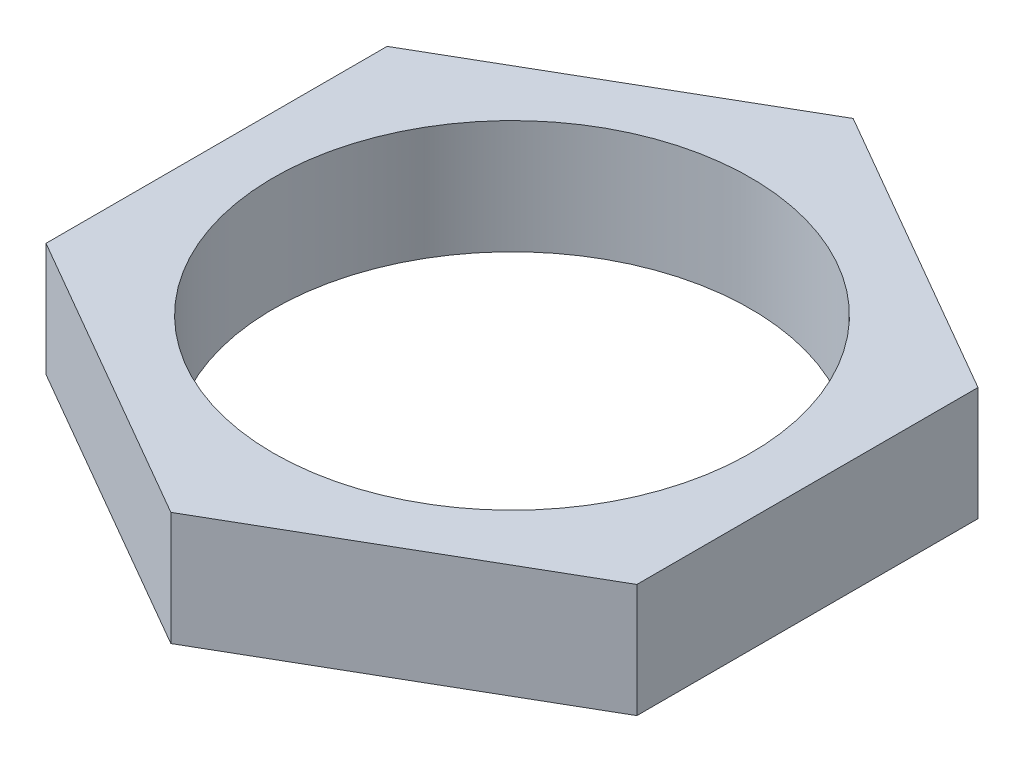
from build123d import *

# Parameters (mm, degrees)
SKETCH1_R           = 10.5
BOSS_EXTRUDE1_DEPTH = 5


with BuildPart() as part:
    # Sketch1 → Boss-Extrude1 (new body)
    with BuildSketch(Plane(origin=(0, 0, 0), x_dir=(1, 0, 0), z_dir=(0, 1, 0))):
        Polygon((0, 15.011106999), (-13, 7.505553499), (-13, -7.505553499), (0, -15.011106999), (13, -7.505553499), (13, 7.505553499), align=None)
        with Locations(Location((0, 0, 0), (0, 0, 270))):
            Circle(SKETCH1_R, mode=Mode.SUBTRACT)
    extrude(amount=BOSS_EXTRUDE1_DEPTH)


solid = part.part
